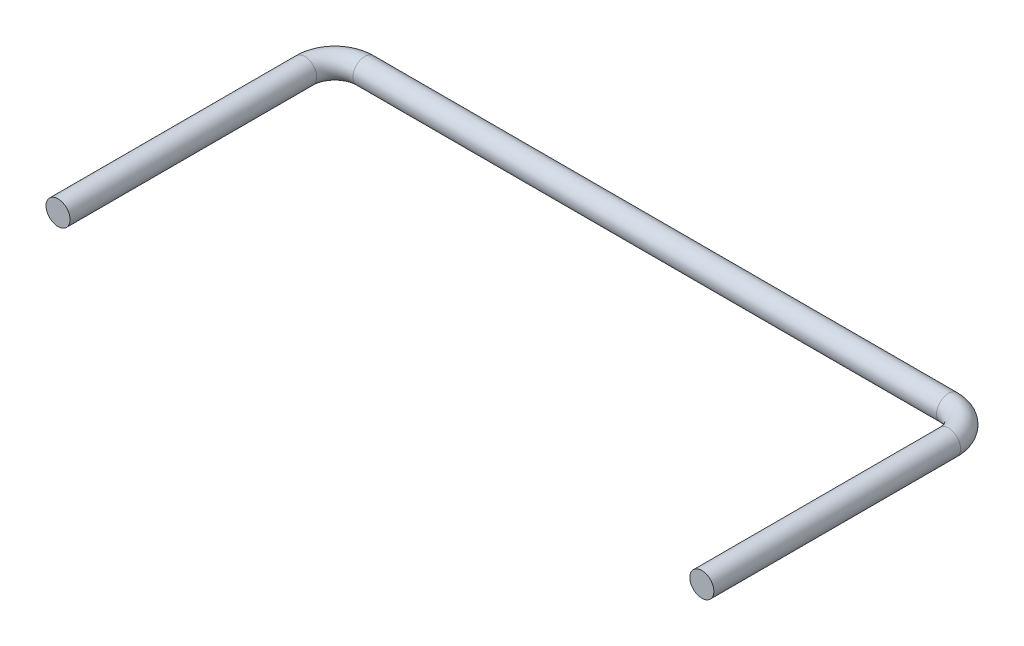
ISO-10303-21;
HEADER;
FILE_DESCRIPTION(('STEP AP214'),'2;1');
FILE_NAME('part.step','',(''),(''),'','','');
FILE_SCHEMA(('AUTOMOTIVE_DESIGN { 1 0 10303 214 1 1 1 1 }'));
ENDSEC;
DATA;
#1=APPLICATION_CONTEXT('core data for automotive mechanical design processes');
#2=APPLICATION_PROTOCOL_DEFINITION('international standard','automotive_design',2000,#1);
#3=PRODUCT_CONTEXT('',#1,'mechanical');
#4=PRODUCT('Part','Part','',(#3));
#5=PRODUCT_RELATED_PRODUCT_CATEGORY('part','',(#4));
#6=PRODUCT_DEFINITION_FORMATION('','',#4);
#7=PRODUCT_DEFINITION_CONTEXT('part definition',#1,'design');
#8=PRODUCT_DEFINITION('design','',#6,#7);
#9=PRODUCT_DEFINITION_SHAPE('','',#8);
#10=(LENGTH_UNIT() NAMED_UNIT(*) SI_UNIT(.MILLI.,.METRE.));
#11=(NAMED_UNIT(*) PLANE_ANGLE_UNIT() SI_UNIT($,.RADIAN.));
#12=(NAMED_UNIT(*) SI_UNIT($,.STERADIAN.) SOLID_ANGLE_UNIT());
#13=UNCERTAINTY_MEASURE_WITH_UNIT(LENGTH_MEASURE(1.E-05),#10,'distance_accuracy_value','');
#14=(GEOMETRIC_REPRESENTATION_CONTEXT(3) GLOBAL_UNCERTAINTY_ASSIGNED_CONTEXT((#13)) GLOBAL_UNIT_ASSIGNED_CONTEXT((#10,
#11,#12)) REPRESENTATION_CONTEXT('',''));
#15=CARTESIAN_POINT('',(0.,0.,0.));
#16=DIRECTION('',(0.,0.,1.));
#17=DIRECTION('',(1.,0.,0.));
#18=AXIS2_PLACEMENT_3D('',#15,#16,#17);
#19=CARTESIAN_POINT('',(53.5,-53.5,-114.));
#20=DIRECTION('',(0.,0.,1.));
#21=DIRECTION('',(1.,0.,0.));
#22=AXIS2_PLACEMENT_3D('',#19,#20,#21);
#23=PLANE('',#22);
#24=CARTESIAN_POINT('',(53.5,-53.5,-114.));
#25=DIRECTION('',(0.,0.,-1.));
#26=DIRECTION('',(-1.,0.,0.));
#27=AXIS2_PLACEMENT_3D('',#24,#25,#26);
#28=CIRCLE('',#27,2.);
#29=CARTESIAN_POINT('',(51.5,-53.5,-114.));
#30=VERTEX_POINT('',#29);
#31=EDGE_CURVE('E17',#30,#30,#28,.T.);
#32=ORIENTED_EDGE('',*,*,#31,.F.);
#33=EDGE_LOOP('',(#32));
#34=FACE_BOUND('',#33,.T.);
#35=ADVANCED_FACE('F14',(#34),#23,.T.);
#36=CARTESIAN_POINT('',(-53.5,-53.5,-114.));
#37=DIRECTION('',(0.,0.,1.));
#38=DIRECTION('',(1.,0.,0.));
#39=AXIS2_PLACEMENT_3D('',#36,#37,#38);
#40=PLANE('',#39);
#41=CARTESIAN_POINT('',(-53.5,-53.5,-114.));
#42=DIRECTION('',(0.,0.,-1.));
#43=DIRECTION('',(-1.,0.,0.));
#44=AXIS2_PLACEMENT_3D('',#41,#42,#43);
#45=CIRCLE('',#44,2.);
#46=CARTESIAN_POINT('',(-55.5,-53.5,-114.));
#47=VERTEX_POINT('',#46);
#48=EDGE_CURVE('E56',#47,#47,#45,.T.);
#49=ORIENTED_EDGE('',*,*,#48,.F.);
#50=EDGE_LOOP('',(#49));
#51=FACE_BOUND('',#50,.T.);
#52=ADVANCED_FACE('F67',(#51),#40,.T.);
#53=CARTESIAN_POINT('',(53.5,-53.5,-134.5));
#54=DIRECTION('',(0.,0.,-1.));
#55=DIRECTION('',(-1.,0.,0.));
#56=AXIS2_PLACEMENT_3D('',#53,#54,#55);
#57=CYLINDRICAL_SURFACE('',#56,2.);
#58=CARTESIAN_POINT('',(53.5,-53.5,-155.));
#59=DIRECTION('',(0.,0.,1.));
#60=DIRECTION('',(1.,0.,0.));
#61=AXIS2_PLACEMENT_3D('',#58,#59,#60);
#62=CIRCLE('',#61,2.);
#63=CARTESIAN_POINT('',(55.5,-53.5,-155.));
#64=VERTEX_POINT('',#63);
#65=EDGE_CURVE('E53',#64,#64,#62,.F.);
#66=ORIENTED_EDGE('',*,*,#65,.F.);
#67=EDGE_LOOP('',(#66));
#68=FACE_BOUND('',#67,.T.);
#69=ORIENTED_EDGE('',*,*,#31,.T.);
#70=EDGE_LOOP('',(#69));
#71=FACE_BOUND('',#70,.T.);
#72=ADVANCED_FACE('F64',(#68,#71),#57,.T.);
#73=CARTESIAN_POINT('',(-53.5,-53.5,-134.5));
#74=DIRECTION('',(0.,0.,-1.));
#75=DIRECTION('',(-1.,0.,0.));
#76=AXIS2_PLACEMENT_3D('',#73,#74,#75);
#77=CYLINDRICAL_SURFACE('',#76,2.);
#78=CARTESIAN_POINT('',(-53.5,-53.5,-155.));
#79=DIRECTION('',(0.,0.,1.));
#80=DIRECTION('',(-1.,0.,0.));
#81=AXIS2_PLACEMENT_3D('',#78,#79,#80);
#82=CIRCLE('',#81,2.);
#83=CARTESIAN_POINT('',(-55.5,-53.5,-155.));
#84=VERTEX_POINT('',#83);
#85=EDGE_CURVE('E26',#84,#84,#82,.F.);
#86=ORIENTED_EDGE('',*,*,#85,.F.);
#87=EDGE_LOOP('',(#86));
#88=FACE_BOUND('',#87,.T.);
#89=ORIENTED_EDGE('',*,*,#48,.T.);
#90=EDGE_LOOP('',(#89));
#91=FACE_BOUND('',#90,.T.);
#92=ADVANCED_FACE('F47',(#88,#91),#77,.T.);
#93=CARTESIAN_POINT('',(48.5,-53.5,-155.));
#94=DIRECTION('',(0.,-1.,0.));
#95=DIRECTION('',(0.,0.,-1.));
#96=AXIS2_PLACEMENT_3D('',#93,#94,#95);
#97=TOROIDAL_SURFACE('',#96,5.,2.);
#98=CARTESIAN_POINT('',(48.5,-53.5,-160.));
#99=DIRECTION('',(-1.,0.,0.));
#100=DIRECTION('',(0.,0.,1.));
#101=AXIS2_PLACEMENT_3D('',#98,#99,#100);
#102=CIRCLE('',#101,2.);
#103=CARTESIAN_POINT('',(48.5,-53.5,-158.));
#104=VERTEX_POINT('',#103);
#105=EDGE_CURVE('E21',#104,#104,#102,.T.);
#106=ORIENTED_EDGE('',*,*,#105,.F.);
#107=EDGE_LOOP('',(#106));
#108=FACE_BOUND('',#107,.T.);
#109=ORIENTED_EDGE('',*,*,#65,.T.);
#110=EDGE_LOOP('',(#109));
#111=FACE_BOUND('',#110,.T.);
#112=ADVANCED_FACE('F42',(#108,#111),#97,.T.);
#113=CARTESIAN_POINT('',(-48.5,-53.5,-155.));
#114=DIRECTION('',(0.,1.,0.));
#115=DIRECTION('',(0.,0.,1.));
#116=AXIS2_PLACEMENT_3D('',#113,#114,#115);
#117=TOROIDAL_SURFACE('',#116,5.,2.);
#118=CARTESIAN_POINT('',(-48.5,-53.5,-160.));
#119=DIRECTION('',(-1.,0.,0.));
#120=DIRECTION('',(0.,0.,1.));
#121=AXIS2_PLACEMENT_3D('',#118,#119,#120);
#122=CIRCLE('',#121,2.);
#123=CARTESIAN_POINT('',(-48.5,-53.5,-158.));
#124=VERTEX_POINT('',#123);
#125=EDGE_CURVE('E10',#124,#124,#122,.F.);
#126=ORIENTED_EDGE('',*,*,#125,.F.);
#127=EDGE_LOOP('',(#126));
#128=FACE_BOUND('',#127,.T.);
#129=ORIENTED_EDGE('',*,*,#85,.T.);
#130=EDGE_LOOP('',(#129));
#131=FACE_BOUND('',#130,.T.);
#132=ADVANCED_FACE('F37',(#128,#131),#117,.T.);
#133=CARTESIAN_POINT('',(0.,-53.5,-160.));
#134=DIRECTION('',(-1.,0.,0.));
#135=DIRECTION('',(0.,0.,1.));
#136=AXIS2_PLACEMENT_3D('',#133,#134,#135);
#137=CYLINDRICAL_SURFACE('',#136,2.);
#138=ORIENTED_EDGE('',*,*,#125,.T.);
#139=EDGE_LOOP('',(#138));
#140=FACE_BOUND('',#139,.T.);
#141=ORIENTED_EDGE('',*,*,#105,.T.);
#142=EDGE_LOOP('',(#141));
#143=FACE_BOUND('',#142,.T.);
#144=ADVANCED_FACE('F41',(#140,#143),#137,.T.);
#145=CLOSED_SHELL('',(#35,#52,#72,#92,#112,#132,#144));
#146=MANIFOLD_SOLID_BREP('B1',#145);
#147=ADVANCED_BREP_SHAPE_REPRESENTATION('',(#18,#146),#14);
#148=SHAPE_DEFINITION_REPRESENTATION(#9,#147);
ENDSEC;
END-ISO-10303-21;
